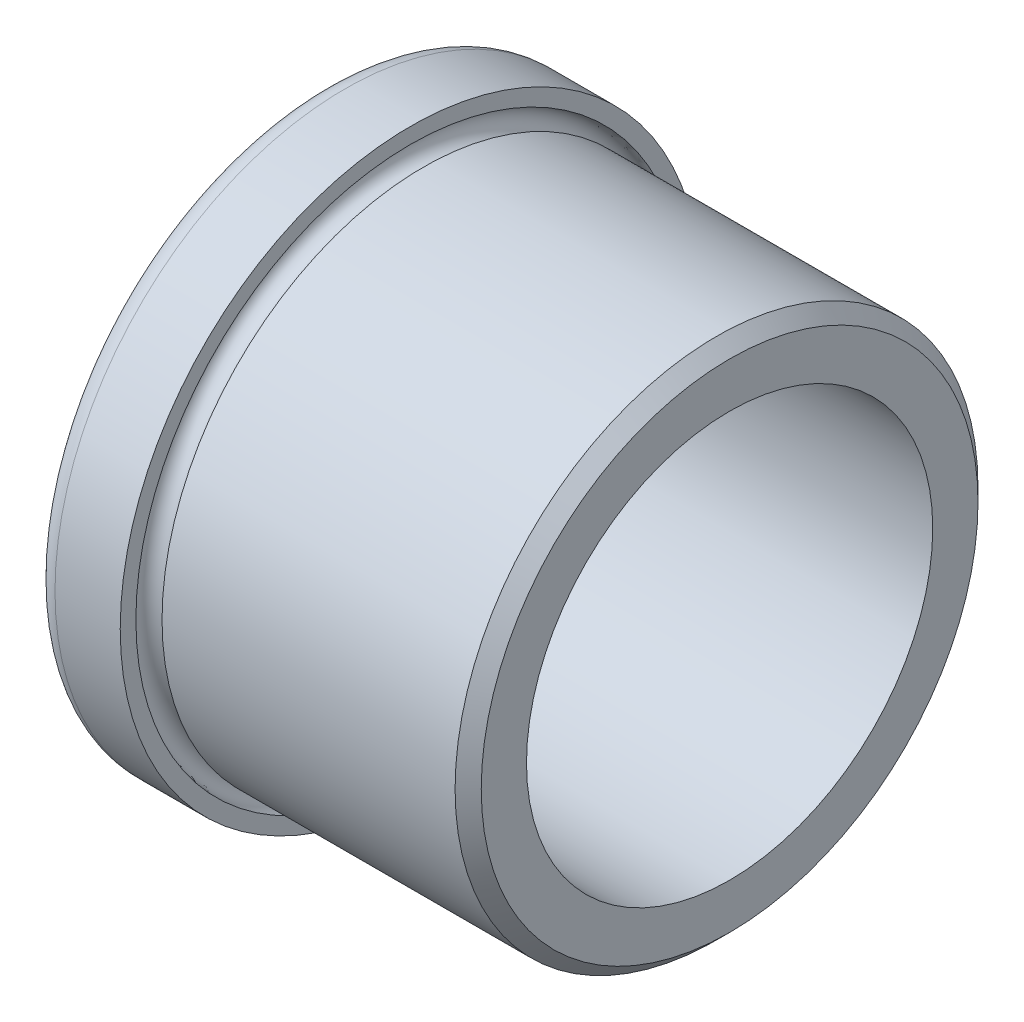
ISO-10303-21;
HEADER;
FILE_DESCRIPTION(('STEP AP214'),'2;1');
FILE_NAME('part.step','',(''),(''),'','','');
FILE_SCHEMA(('AUTOMOTIVE_DESIGN { 1 0 10303 214 1 1 1 1 }'));
ENDSEC;
DATA;
#1=APPLICATION_CONTEXT('core data for automotive mechanical design processes');
#2=APPLICATION_PROTOCOL_DEFINITION('international standard','automotive_design',2000,#1);
#3=PRODUCT_CONTEXT('',#1,'mechanical');
#4=PRODUCT('Part','Part','',(#3));
#5=PRODUCT_RELATED_PRODUCT_CATEGORY('part','',(#4));
#6=PRODUCT_DEFINITION_FORMATION('','',#4);
#7=PRODUCT_DEFINITION_CONTEXT('part definition',#1,'design');
#8=PRODUCT_DEFINITION('design','',#6,#7);
#9=PRODUCT_DEFINITION_SHAPE('','',#8);
#10=(LENGTH_UNIT() NAMED_UNIT(*) SI_UNIT(.MILLI.,.METRE.));
#11=(NAMED_UNIT(*) PLANE_ANGLE_UNIT() SI_UNIT($,.RADIAN.));
#12=(NAMED_UNIT(*) SI_UNIT($,.STERADIAN.) SOLID_ANGLE_UNIT());
#13=UNCERTAINTY_MEASURE_WITH_UNIT(LENGTH_MEASURE(1.E-05),#10,'distance_accuracy_value','');
#14=(GEOMETRIC_REPRESENTATION_CONTEXT(3) GLOBAL_UNCERTAINTY_ASSIGNED_CONTEXT((#13)) GLOBAL_UNIT_ASSIGNED_CONTEXT((#10,
#11,#12)) REPRESENTATION_CONTEXT('',''));
#15=CARTESIAN_POINT('',(0.,0.,0.));
#16=DIRECTION('',(0.,0.,1.));
#17=DIRECTION('',(1.,0.,0.));
#18=AXIS2_PLACEMENT_3D('',#15,#16,#17);
#19=CARTESIAN_POINT('',(9.52499999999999,31.75,0.));
#20=DIRECTION('',(1.,0.,0.));
#21=DIRECTION('',(0.,0.,-1.));
#22=AXIS2_PLACEMENT_3D('',#19,#20,#21);
#23=PLANE('',#22);
#24=CARTESIAN_POINT('',(9.52499999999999,0.,0.));
#25=DIRECTION('',(-1.,0.,0.));
#26=DIRECTION('',(0.,0.,1.));
#27=AXIS2_PLACEMENT_3D('',#24,#25,#26);
#28=CIRCLE('',#27,30.0370875);
#29=CARTESIAN_POINT('',(9.52499999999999,0.,30.0370875));
#30=VERTEX_POINT('',#29);
#31=EDGE_CURVE('E65',#30,#30,#28,.T.);
#32=ORIENTED_EDGE('',*,*,#31,.T.);
#33=EDGE_LOOP('',(#32));
#34=FACE_BOUND('',#33,.T.);
#35=CARTESIAN_POINT('',(9.52499999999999,0.,0.));
#36=DIRECTION('',(-1.,0.,0.));
#37=DIRECTION('',(0.,0.,1.));
#38=AXIS2_PLACEMENT_3D('',#35,#36,#37);
#39=CIRCLE('',#38,31.75);
#40=CARTESIAN_POINT('',(9.52499999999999,0.,31.75));
#41=VERTEX_POINT('',#40);
#42=EDGE_CURVE('E10',#41,#41,#39,.T.);
#43=ORIENTED_EDGE('',*,*,#42,.F.);
#44=EDGE_LOOP('',(#43));
#45=FACE_BOUND('',#44,.T.);
#46=ADVANCED_FACE('F31',(#34,#45),#23,.T.);
#47=CARTESIAN_POINT('',(0.,0.,0.));
#48=DIRECTION('',(-1.,0.,0.));
#49=DIRECTION('',(0.,0.,1.));
#50=AXIS2_PLACEMENT_3D('',#47,#48,#49);
#51=CYLINDRICAL_SURFACE('',#50,31.75);
#52=ORIENTED_EDGE('',*,*,#42,.T.);
#53=EDGE_LOOP('',(#52));
#54=FACE_BOUND('',#53,.T.);
#55=CARTESIAN_POINT('',(2.3876,0.,0.));
#56=DIRECTION('',(-1.,0.,0.));
#57=DIRECTION('',(0.,0.,1.));
#58=AXIS2_PLACEMENT_3D('',#55,#56,#57);
#59=CIRCLE('',#58,31.75);
#60=CARTESIAN_POINT('',(2.3876,0.,31.75));
#61=VERTEX_POINT('',#60);
#62=EDGE_CURVE('E37',#61,#61,#59,.T.);
#63=ORIENTED_EDGE('',*,*,#62,.F.);
#64=EDGE_LOOP('',(#63));
#65=FACE_BOUND('',#64,.T.);
#66=ADVANCED_FACE('F83',(#54,#65),#51,.T.);
#67=CARTESIAN_POINT('',(2.3876,0.,0.));
#68=DIRECTION('',(-1.,0.,0.));
#69=DIRECTION('',(0.,0.,1.));
#70=AXIS2_PLACEMENT_3D('',#67,#68,#69);
#71=TOROIDAL_SURFACE('',#70,29.3624,2.3876);
#72=CARTESIAN_POINT('',(0.,0.,0.));
#73=DIRECTION('',(-1.,0.,0.));
#74=DIRECTION('',(0.,0.,1.));
#75=AXIS2_PLACEMENT_3D('',#72,#73,#74);
#76=CIRCLE('',#75,29.3624);
#77=CARTESIAN_POINT('',(0.,0.,29.3624));
#78=VERTEX_POINT('',#77);
#79=EDGE_CURVE('E41',#78,#78,#76,.T.);
#80=ORIENTED_EDGE('',*,*,#79,.F.);
#81=EDGE_LOOP('',(#80));
#82=FACE_BOUND('',#81,.T.);
#83=ORIENTED_EDGE('',*,*,#62,.T.);
#84=EDGE_LOOP('',(#83));
#85=FACE_BOUND('',#84,.T.);
#86=ADVANCED_FACE('F87',(#82,#85),#71,.T.);
#87=CARTESIAN_POINT('',(0.,24.6126,0.));
#88=DIRECTION('',(-1.,0.,0.));
#89=DIRECTION('',(0.,0.,1.));
#90=AXIS2_PLACEMENT_3D('',#87,#88,#89);
#91=PLANE('',#90);
#92=ORIENTED_EDGE('',*,*,#79,.T.);
#93=EDGE_LOOP('',(#92));
#94=FACE_BOUND('',#93,.T.);
#95=CARTESIAN_POINT('',(0.,0.,0.));
#96=DIRECTION('',(-1.,0.,0.));
#97=DIRECTION('',(0.,0.,1.));
#98=AXIS2_PLACEMENT_3D('',#95,#96,#97);
#99=CIRCLE('',#98,24.6126);
#100=CARTESIAN_POINT('',(0.,0.,24.6126));
#101=VERTEX_POINT('',#100);
#102=EDGE_CURVE('E45',#101,#101,#99,.T.);
#103=ORIENTED_EDGE('',*,*,#102,.F.);
#104=EDGE_LOOP('',(#103));
#105=FACE_BOUND('',#104,.T.);
#106=ADVANCED_FACE('F91',(#94,#105),#91,.T.);
#107=CARTESIAN_POINT('',(2.3876,0.,0.));
#108=DIRECTION('',(-1.,0.,0.));
#109=DIRECTION('',(0.,0.,1.));
#110=AXIS2_PLACEMENT_3D('',#107,#108,#109);
#111=TOROIDAL_SURFACE('',#110,24.6126,2.3876);
#112=CARTESIAN_POINT('',(2.3876,0.,0.));
#113=DIRECTION('',(-1.,0.,0.));
#114=DIRECTION('',(0.,0.,1.));
#115=AXIS2_PLACEMENT_3D('',#112,#113,#114);
#116=CIRCLE('',#115,22.225);
#117=CARTESIAN_POINT('',(2.3876,0.,22.225));
#118=VERTEX_POINT('',#117);
#119=EDGE_CURVE('E50',#118,#118,#116,.T.);
#120=ORIENTED_EDGE('',*,*,#119,.F.);
#121=EDGE_LOOP('',(#120));
#122=FACE_BOUND('',#121,.T.);
#123=ORIENTED_EDGE('',*,*,#102,.T.);
#124=EDGE_LOOP('',(#123));
#125=FACE_BOUND('',#124,.T.);
#126=ADVANCED_FACE('F98',(#122,#125),#111,.T.);
#127=CARTESIAN_POINT('',(0.,0.,0.));
#128=DIRECTION('',(-1.,0.,0.));
#129=DIRECTION('',(0.,0.,1.));
#130=AXIS2_PLACEMENT_3D('',#127,#128,#129);
#131=CYLINDRICAL_SURFACE('',#130,22.225);
#132=ORIENTED_EDGE('',*,*,#119,.T.);
#133=EDGE_LOOP('',(#132));
#134=FACE_BOUND('',#133,.T.);
#135=CARTESIAN_POINT('',(44.4499999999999,0.,0.));
#136=DIRECTION('',(-1.,0.,0.));
#137=DIRECTION('',(0.,0.,1.));
#138=AXIS2_PLACEMENT_3D('',#135,#136,#137);
#139=CIRCLE('',#138,22.225);
#140=CARTESIAN_POINT('',(44.4499999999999,0.,22.225));
#141=VERTEX_POINT('',#140);
#142=EDGE_CURVE('E53',#141,#141,#139,.T.);
#143=ORIENTED_EDGE('',*,*,#142,.F.);
#144=EDGE_LOOP('',(#143));
#145=FACE_BOUND('',#144,.T.);
#146=ADVANCED_FACE('F102',(#134,#145),#131,.F.);
#147=CARTESIAN_POINT('',(44.4499999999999,27.1764125,0.));
#148=DIRECTION('',(1.,0.,0.));
#149=DIRECTION('',(0.,0.,-1.));
#150=AXIS2_PLACEMENT_3D('',#147,#148,#149);
#151=PLANE('',#150);
#152=ORIENTED_EDGE('',*,*,#142,.T.);
#153=EDGE_LOOP('',(#152));
#154=FACE_BOUND('',#153,.T.);
#155=CARTESIAN_POINT('',(44.4499999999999,0.,0.));
#156=DIRECTION('',(-1.,0.,0.));
#157=DIRECTION('',(0.,0.,1.));
#158=AXIS2_PLACEMENT_3D('',#155,#156,#157);
#159=CIRCLE('',#158,27.1764125);
#160=CARTESIAN_POINT('',(44.4499999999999,0.,27.1764125));
#161=VERTEX_POINT('',#160);
#162=EDGE_CURVE('E56',#161,#161,#159,.T.);
#163=ORIENTED_EDGE('',*,*,#162,.F.);
#164=EDGE_LOOP('',(#163));
#165=FACE_BOUND('',#164,.T.);
#166=ADVANCED_FACE('F106',(#154,#165),#151,.T.);
#167=CARTESIAN_POINT('',(43.0196624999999,0.,0.));
#168=DIRECTION('',(-1.,0.,0.));
#169=DIRECTION('',(0.,0.,1.));
#170=AXIS2_PLACEMENT_3D('',#167,#168,#169);
#171=CONICAL_SURFACE('',#170,28.60675,0.785398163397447);
#172=ORIENTED_EDGE('',*,*,#162,.T.);
#173=EDGE_LOOP('',(#172));
#174=FACE_BOUND('',#173,.T.);
#175=CARTESIAN_POINT('',(43.0196624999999,0.,0.));
#176=DIRECTION('',(-1.,0.,0.));
#177=DIRECTION('',(0.,0.,1.));
#178=AXIS2_PLACEMENT_3D('',#175,#176,#177);
#179=CIRCLE('',#178,28.60675);
#180=CARTESIAN_POINT('',(43.0196624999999,0.,28.60675));
#181=VERTEX_POINT('',#180);
#182=EDGE_CURVE('E59',#181,#181,#179,.T.);
#183=ORIENTED_EDGE('',*,*,#182,.F.);
#184=EDGE_LOOP('',(#183));
#185=FACE_BOUND('',#184,.T.);
#186=ADVANCED_FACE('F79',(#174,#185),#171,.T.);
#187=CARTESIAN_POINT('',(0.,0.,0.));
#188=DIRECTION('',(-1.,0.,0.));
#189=DIRECTION('',(0.,0.,1.));
#190=AXIS2_PLACEMENT_3D('',#187,#188,#189);
#191=CYLINDRICAL_SURFACE('',#190,28.60675);
#192=ORIENTED_EDGE('',*,*,#182,.T.);
#193=EDGE_LOOP('',(#192));
#194=FACE_BOUND('',#193,.T.);
#195=CARTESIAN_POINT('',(10.9553375,0.,0.));
#196=DIRECTION('',(-1.,0.,0.));
#197=DIRECTION('',(0.,0.,1.));
#198=AXIS2_PLACEMENT_3D('',#195,#196,#197);
#199=CIRCLE('',#198,28.60675);
#200=CARTESIAN_POINT('',(10.9553375,0.,28.60675));
#201=VERTEX_POINT('',#200);
#202=EDGE_CURVE('E62',#201,#201,#199,.T.);
#203=ORIENTED_EDGE('',*,*,#202,.F.);
#204=EDGE_LOOP('',(#203));
#205=FACE_BOUND('',#204,.T.);
#206=ADVANCED_FACE('F73',(#194,#205),#191,.T.);
#207=CARTESIAN_POINT('',(9.52499999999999,0.,0.));
#208=DIRECTION('',(-1.,0.,0.));
#209=DIRECTION('',(0.,0.,1.));
#210=AXIS2_PLACEMENT_3D('',#207,#208,#209);
#211=TOROIDAL_SURFACE('',#210,28.60675,1.4303375);
#212=ORIENTED_EDGE('',*,*,#202,.T.);
#213=EDGE_LOOP('',(#212));
#214=FACE_BOUND('',#213,.T.);
#215=ORIENTED_EDGE('',*,*,#31,.F.);
#216=EDGE_LOOP('',(#215));
#217=FACE_BOUND('',#216,.T.);
#218=ADVANCED_FACE('F71',(#214,#217),#211,.F.);
#219=CLOSED_SHELL('',(#46,#66,#86,#106,#126,#146,#166,#186,#206,#218));
#220=MANIFOLD_SOLID_BREP('B2',#219);
#221=ADVANCED_BREP_SHAPE_REPRESENTATION('',(#18,#220),#14);
#222=SHAPE_DEFINITION_REPRESENTATION(#9,#221);
ENDSEC;
END-ISO-10303-21;
